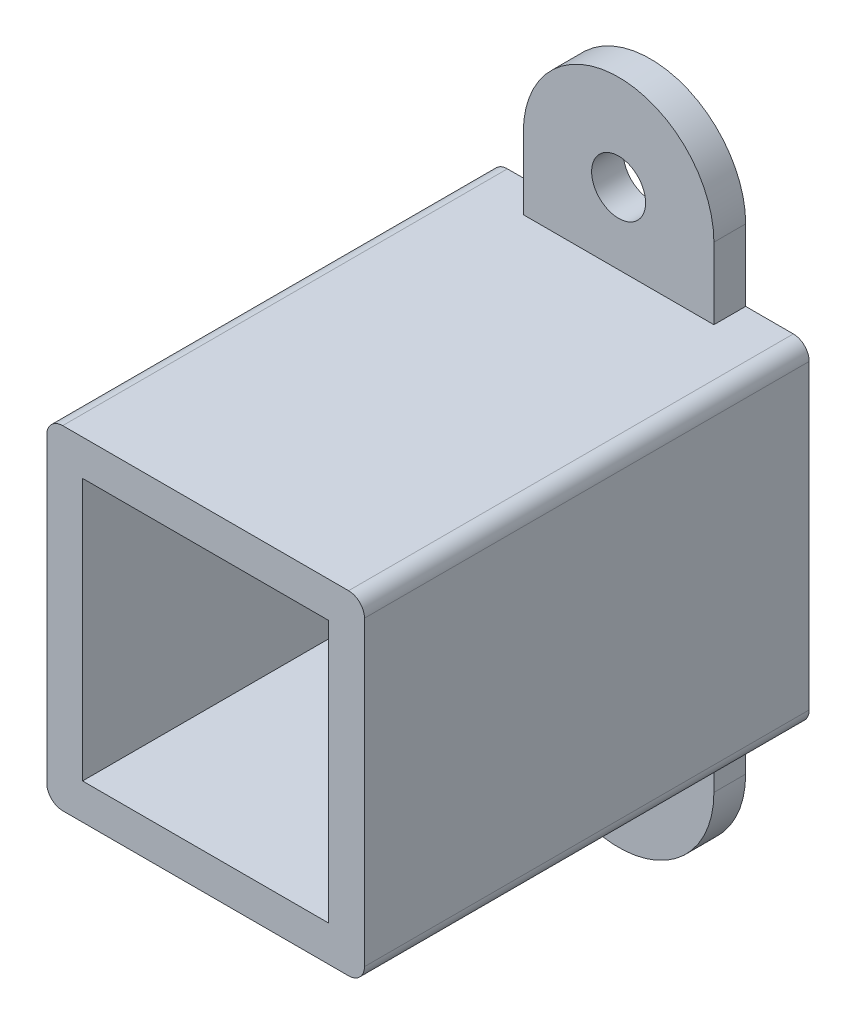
from build123d import *

# Parameters (mm, degrees)
SKETCH1_W            = 20
SKETCH1_H            = 21
SKETCH1_W_2          = 15.5
SKETCH1_H_2          = 16.5
BOSS_EXTRUDE2_DEPTH  = 28
BOSS_EXTRUDE3_DEPTH  = 2
M3_CLEARANCE_HOLE1_D = 3.4
FILLET1_R            = 1


with BuildPart() as part:
    # Sketch1 → Boss-Extrude2 (new body)
    with BuildSketch(Plane.XY):
        Rectangle(SKETCH1_W, SKETCH1_H)
        Rectangle(SKETCH1_W_2, SKETCH1_H_2, mode=Mode.SUBTRACT)
    extrude(amount=BOSS_EXTRUDE2_DEPTH)

    # Sketch2 → Boss-Extrude3 (add)
    with BuildSketch(Plane(origin=(0, 0, 0), x_dir=(-1, 0, 0), z_dir=(0, 0, -1))):
        with BuildLine():
            Line((-6, 10.5), (-6, 15))
            ThreePointArc((-6, 15), (0, 21), (6, 15))
            Line((6, 15), (6, 10.5))
            Line((6, 10.5), (10, 10.5))
            Line((10, 10.5), (10, -10.5))
            Line((10, -10.5), (6, -10.5))
            Line((6, -10.5), (6, -15))
            ThreePointArc((6, -15), (0, -21), (-6, -15))
            Line((-6, -15), (-6, -10.5))
            Line((-6, -10.5), (-10, -10.5))
            Line((-10, -10.5), (-10, 10.5))
            Line((-10, 10.5), (-6, 10.5))
        make_face()
    extrude(amount=-BOSS_EXTRUDE3_DEPTH)

    # M3 Clearance Hole1 (through all)
    with Locations(Plane.XY.offset(2)):
        with Locations((0, 15), (0, -15)):
            Hole(M3_CLEARANCE_HOLE1_D / 2)

    # Fillet1
    fillet1_edges = [part.edges().sort_by_distance(p)[0] for p in [
        (10, -10.5, 14),
        (-10, -10.5, 14),
        (-10, 10.5, 14),
        (10, 10.5, 14),
    ]]
    fillet(fillet1_edges, radius=FILLET1_R)


solid = part.part
